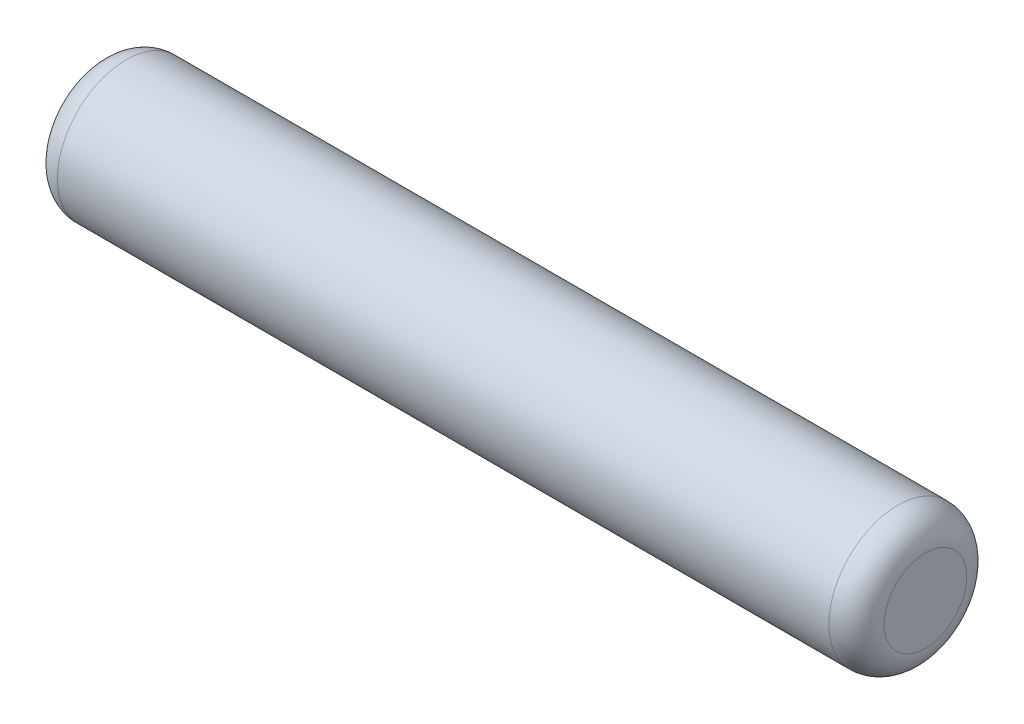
ISO-10303-21;
HEADER;
FILE_DESCRIPTION(('STEP AP214'),'2;1');
FILE_NAME('part.step','',(''),(''),'','','');
FILE_SCHEMA(('AUTOMOTIVE_DESIGN { 1 0 10303 214 1 1 1 1 }'));
ENDSEC;
DATA;
#1=APPLICATION_CONTEXT('core data for automotive mechanical design processes');
#2=APPLICATION_PROTOCOL_DEFINITION('international standard','automotive_design',2000,#1);
#3=PRODUCT_CONTEXT('',#1,'mechanical');
#4=PRODUCT('Part','Part','',(#3));
#5=PRODUCT_RELATED_PRODUCT_CATEGORY('part','',(#4));
#6=PRODUCT_DEFINITION_FORMATION('','',#4);
#7=PRODUCT_DEFINITION_CONTEXT('part definition',#1,'design');
#8=PRODUCT_DEFINITION('design','',#6,#7);
#9=PRODUCT_DEFINITION_SHAPE('','',#8);
#10=(LENGTH_UNIT() NAMED_UNIT(*) SI_UNIT(.MILLI.,.METRE.));
#11=(NAMED_UNIT(*) PLANE_ANGLE_UNIT() SI_UNIT($,.RADIAN.));
#12=(NAMED_UNIT(*) SI_UNIT($,.STERADIAN.) SOLID_ANGLE_UNIT());
#13=UNCERTAINTY_MEASURE_WITH_UNIT(LENGTH_MEASURE(1.E-05),#10,'distance_accuracy_value','');
#14=(GEOMETRIC_REPRESENTATION_CONTEXT(3) GLOBAL_UNCERTAINTY_ASSIGNED_CONTEXT((#13)) GLOBAL_UNIT_ASSIGNED_CONTEXT((#10,
#11,#12)) REPRESENTATION_CONTEXT('',''));
#15=CARTESIAN_POINT('',(0.,0.,0.));
#16=DIRECTION('',(0.,0.,1.));
#17=DIRECTION('',(1.,0.,0.));
#18=AXIS2_PLACEMENT_3D('',#15,#16,#17);
#19=CARTESIAN_POINT('',(0.,0.,0.));
#20=DIRECTION('',(1.,0.,0.));
#21=DIRECTION('',(0.,0.,-1.));
#22=AXIS2_PLACEMENT_3D('',#19,#20,#21);
#23=PLANE('',#22);
#24=CARTESIAN_POINT('',(0.,0.,0.));
#25=DIRECTION('',(1.,0.,0.));
#26=DIRECTION('',(0.,0.,-1.));
#27=AXIS2_PLACEMENT_3D('',#24,#25,#26);
#28=CIRCLE('',#27,3.);
#29=CARTESIAN_POINT('',(0.,0.,-3.));
#30=VERTEX_POINT('',#29);
#31=EDGE_CURVE('E30',#30,#30,#28,.F.);
#32=ORIENTED_EDGE('',*,*,#31,.T.);
#33=EDGE_LOOP('',(#32));
#34=FACE_BOUND('',#33,.T.);
#35=ADVANCED_FACE('F15',(#34),#23,.F.);
#36=CARTESIAN_POINT('',(0.,0.,0.));
#37=DIRECTION('',(-1.,0.,0.));
#38=DIRECTION('',(0.,0.,1.));
#39=AXIS2_PLACEMENT_3D('',#36,#37,#38);
#40=CYLINDRICAL_SURFACE('',#39,5.);
#41=CARTESIAN_POINT('',(2.,0.,0.));
#42=DIRECTION('',(1.,0.,0.));
#43=DIRECTION('',(0.,0.,-1.));
#44=AXIS2_PLACEMENT_3D('',#41,#42,#43);
#45=CIRCLE('',#44,5.);
#46=CARTESIAN_POINT('',(2.,0.,-5.));
#47=VERTEX_POINT('',#46);
#48=EDGE_CURVE('E22',#47,#47,#45,.T.);
#49=ORIENTED_EDGE('',*,*,#48,.T.);
#50=EDGE_LOOP('',(#49));
#51=FACE_BOUND('',#50,.T.);
#52=CARTESIAN_POINT('',(58.,0.,0.));
#53=DIRECTION('',(-1.,0.,0.));
#54=DIRECTION('',(0.,0.,1.));
#55=AXIS2_PLACEMENT_3D('',#52,#53,#54);
#56=CIRCLE('',#55,5.);
#57=CARTESIAN_POINT('',(58.,0.,5.));
#58=VERTEX_POINT('',#57);
#59=EDGE_CURVE('E26',#58,#58,#56,.T.);
#60=ORIENTED_EDGE('',*,*,#59,.T.);
#61=EDGE_LOOP('',(#60));
#62=FACE_BOUND('',#61,.T.);
#63=ADVANCED_FACE('F48',(#51,#62),#40,.T.);
#64=CARTESIAN_POINT('',(60.,5.,0.));
#65=DIRECTION('',(-1.,0.,0.));
#66=DIRECTION('',(0.,0.,1.));
#67=AXIS2_PLACEMENT_3D('',#64,#65,#66);
#68=PLANE('',#67);
#69=CARTESIAN_POINT('',(60.,0.,0.));
#70=DIRECTION('',(-1.,0.,0.));
#71=DIRECTION('',(0.,0.,1.));
#72=AXIS2_PLACEMENT_3D('',#69,#70,#71);
#73=CIRCLE('',#72,3.);
#74=CARTESIAN_POINT('',(60.,0.,3.));
#75=VERTEX_POINT('',#74);
#76=EDGE_CURVE('E10',#75,#75,#73,.F.);
#77=ORIENTED_EDGE('',*,*,#76,.T.);
#78=EDGE_LOOP('',(#77));
#79=FACE_BOUND('',#78,.T.);
#80=ADVANCED_FACE('F39',(#79),#68,.F.);
#81=CARTESIAN_POINT('',(2.,0.,0.));
#82=DIRECTION('',(1.,0.,0.));
#83=DIRECTION('',(0.,0.,-1.));
#84=AXIS2_PLACEMENT_3D('',#81,#82,#83);
#85=TOROIDAL_SURFACE('',#84,3.,2.);
#86=ORIENTED_EDGE('',*,*,#48,.F.);
#87=EDGE_LOOP('',(#86));
#88=FACE_BOUND('',#87,.T.);
#89=ORIENTED_EDGE('',*,*,#31,.F.);
#90=EDGE_LOOP('',(#89));
#91=FACE_BOUND('',#90,.T.);
#92=ADVANCED_FACE('F37',(#88,#91),#85,.T.);
#93=CARTESIAN_POINT('',(58.,0.,0.));
#94=DIRECTION('',(-1.,0.,0.));
#95=DIRECTION('',(0.,0.,1.));
#96=AXIS2_PLACEMENT_3D('',#93,#94,#95);
#97=TOROIDAL_SURFACE('',#96,3.,2.);
#98=ORIENTED_EDGE('',*,*,#76,.F.);
#99=EDGE_LOOP('',(#98));
#100=FACE_BOUND('',#99,.T.);
#101=ORIENTED_EDGE('',*,*,#59,.F.);
#102=EDGE_LOOP('',(#101));
#103=FACE_BOUND('',#102,.T.);
#104=ADVANCED_FACE('F17',(#100,#103),#97,.T.);
#105=CLOSED_SHELL('',(#35,#63,#80,#92,#104));
#106=MANIFOLD_SOLID_BREP('B1',#105);
#107=ADVANCED_BREP_SHAPE_REPRESENTATION('',(#18,#106),#14);
#108=SHAPE_DEFINITION_REPRESENTATION(#9,#107);
ENDSEC;
END-ISO-10303-21;
